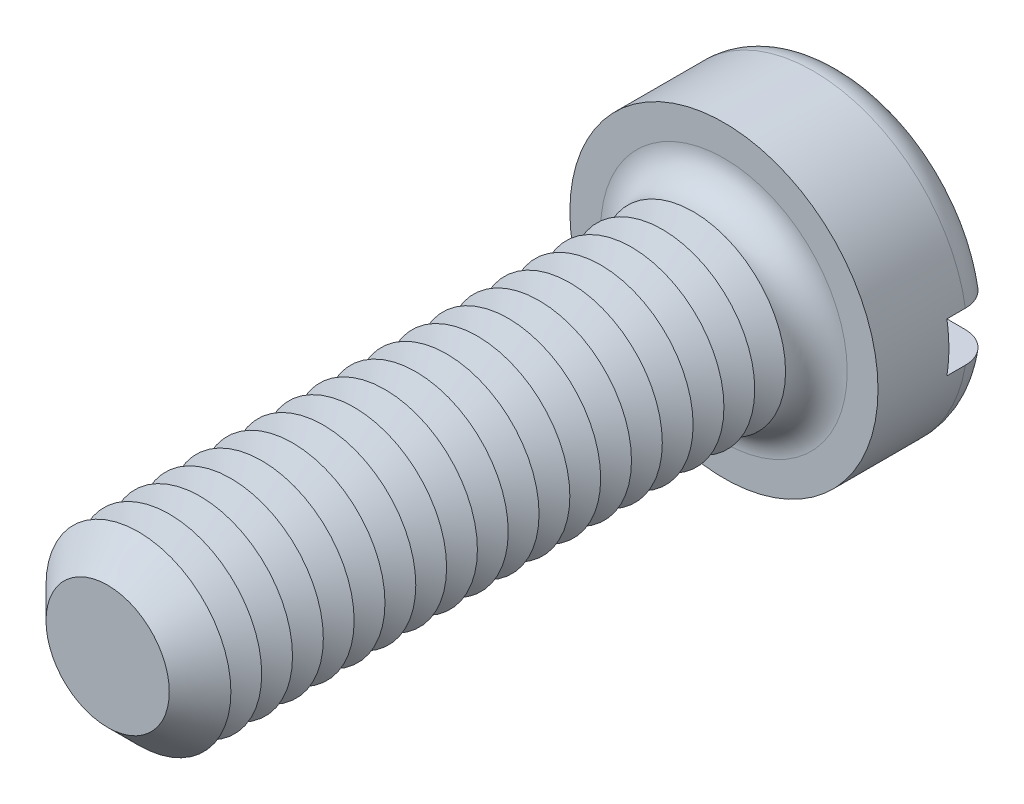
from build123d import *

# Parameters (mm, degrees)
SKETCH3_R           = 5
BOSS_EXTRUDE2_DEPTH = 3.9
SKETCH4_R           = 3
BOSS_EXTRUDE3_DEPTH = 20
FILLET1_R           = 1
CHAMFER1_SIZE       = 1
LPATTERN1_COUNT     = 18
LPATTERN1_PITCH     = 1
SKETCH8_W           = 10
SKETCH8_H           = 1.6
CUT_EXTRUDE1_DEPTH  = 1.6


with BuildPart() as part:
    # Sketch3 → Boss-Extrude2 (new body)
    with BuildSketch(Plane.XY):
        Circle(SKETCH3_R)
    extrude(amount=-BOSS_EXTRUDE2_DEPTH)

    # Sketch4 → Boss-Extrude3 (add)
    with BuildSketch(Plane.XY):
        Circle(SKETCH4_R)
    extrude(amount=BOSS_EXTRUDE3_DEPTH)

    # Fillet1
    fillet1_edges = [part.edges().sort_by_distance(p)[0] for p in [
        (-5, 0, -3.9),
        (-3, 0, 0),
    ]]
    fillet(fillet1_edges, radius=FILLET1_R)

    # Chamfer1
    chamfer1_edges = [part.edges().sort_by_distance(p)[0] for p in [
        (-3, 0, 20),
    ]]
    chamfer(chamfer1_edges, length=CHAMFER1_SIZE)

    # Sketch6 → Cut-Revolve1 (revolve, cut)
    with BuildSketch(Plane(origin=(0, 0, 0), x_dir=(0, 0, -1), z_dir=(1, 0, 0)), mode=Mode.PRIVATE) as cut_revolve1_sk:
        Polygon((-1, 3), (-1.5, 2.133974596), (-2, 3), align=None)
    cut_revolve1 = revolve(cut_revolve1_sk.sketch.rotate(Axis((0, 0, -1.694361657), (0, 0, 1)), 90), axis=Axis((0, 0, -1.694361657), (0, 0, 1)), mode=Mode.SUBTRACT)

    # LPattern1: Cut-Revolve1 ×18
    with Locations(*[(0, 0, i * LPATTERN1_PITCH) for i in range(1, LPATTERN1_COUNT)]):
        add(cut_revolve1, mode=Mode.SUBTRACT)

    # Sketch8 → Cut-Extrude1 (cut)
    with BuildSketch(Plane(origin=(0, 0, -3.9), x_dir=(-1, 0, 0), z_dir=(0, 0, -1))):
        Rectangle(SKETCH8_W, SKETCH8_H)
    extrude(amount=-CUT_EXTRUDE1_DEPTH, mode=Mode.SUBTRACT)


solid = part.part
